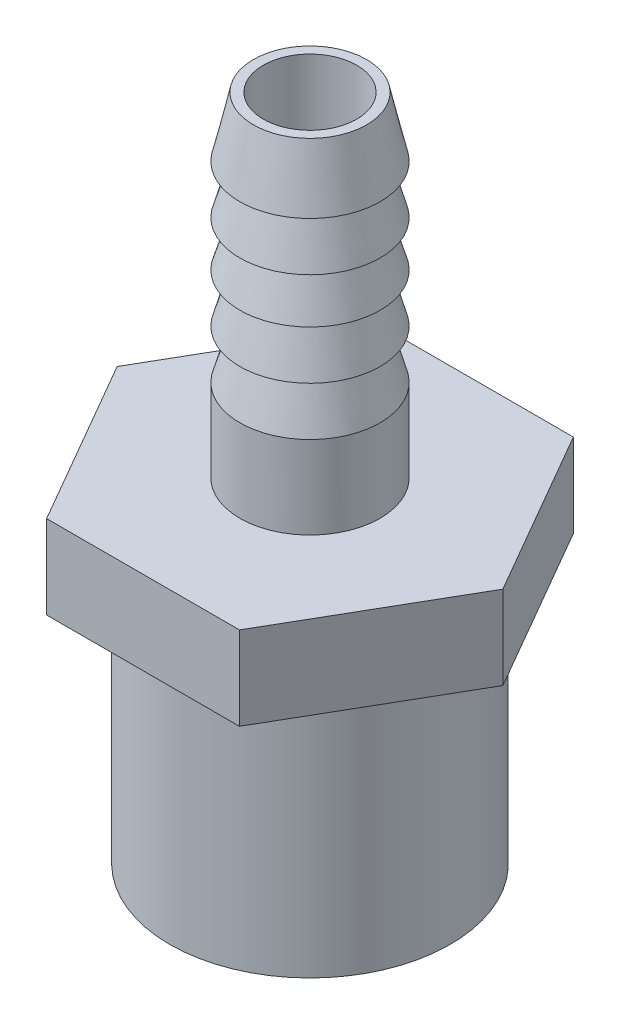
from build123d import *

# Parameters (mm, degrees)
BOSS_EXTRUDE1_DEPTH = 6.35
SKETCH3_R           = 10.668
SKETCH3_R_2         = 7.8994
BOSS_EXTRUDE2_DEPTH = 19.05


with BuildPart() as part:
    # Sketch1 → Boss-Extrude1 (new body)
    with BuildSketch(Plane(origin=(0, 0, 0), x_dir=(1, 0, 0), z_dir=(0, 1, 0))):
        Polygon((-7.330101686, -12.701296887), (7.334594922, -12.698702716), (14.664696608, 0.002594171), (7.330101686, 12.701296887), (-7.334594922, 12.698702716), (-14.664696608, -0.002594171), align=None)
    extrude(amount=BOSS_EXTRUDE1_DEPTH)

    # Sketch2 → Revolve1 (revolve)
    with BuildSketch(Plane.XY, mode=Mode.PRIVATE) as revolve1_sk:
        Polygon((5.334, 12.640717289), (5.334, 6.35), (3.556, 6.35), (3.556, 31.75), (4.306063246, 31.75), (5.334, 27.199588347), (4.306063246, 27.199588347), (5.334, 23.494486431), (4.306063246, 23.494486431), (5.334, 20.050921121), (4.306063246, 20.050921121), (5.334, 16.345819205), (4.306063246, 16.345819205), align=None)
    revolve(revolve1_sk.sketch.rotate(Axis((0, -18.558256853, 0), (0, 1, 0)), 90), axis=Axis((0, -18.558256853, 0), (0, 1, 0)))

    # Sketch3 → Boss-Extrude2 (add)
    with BuildSketch(Plane.XZ):
        with Locations(Location((0, 0, 0), (0, 0, 90))):
            Circle(SKETCH3_R)
        with Locations(Location((0, 0, 0), (0, 0, 90))):
            Circle(SKETCH3_R_2, mode=Mode.SUBTRACT)
    extrude(amount=BOSS_EXTRUDE2_DEPTH)


solid = part.part
